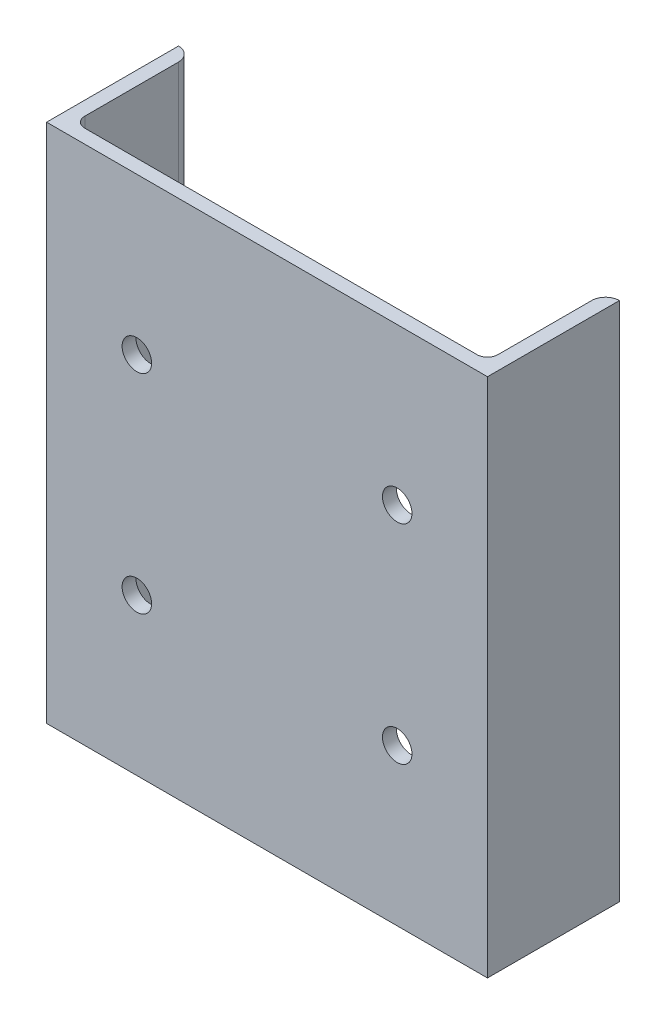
from build123d import *

# Parameters (mm, degrees)
EXTRUDE1_DEPTH     = 150
CUT_EXTRUDE1_REACH = 212.725
SKETCH2_R          = 8.5


with BuildPart() as part:
    # Sketch1 → Extrude1 (new, symmetric)
    with BuildSketch(Plane(origin=(0, 0, 0), x_dir=(1, 0, 0), z_dir=(0, 1, 0))):
        with BuildLine():
            Line((-127, 0), (127, 0))
            Line((127, 0), (127, 76))
            ThreePointArc((127, 76), (121.343145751, 73.656854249), (119, 68))
            Line((119, 68), (119, 14))
            ThreePointArc((119, 14), (117.242640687, 9.757359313), (113, 8))
            Line((113, 8), (-113, 8))
            ThreePointArc((-113, 8), (-117.242640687, 9.757359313), (-119, 14))
            Line((-119, 14), (-119, 68))
            ThreePointArc((-119, 68), (-121.343145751, 73.656854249), (-127, 76))
            Line((-127, 76), (-127, 0))
        make_face()
    extrude(amount=EXTRUDE1_DEPTH, both=True)

    # Sketch2 → Cut-Extrude1 (cut, up to next)
    with BuildSketch(Plane.XY, mode=Mode.PRIVATE) as cut_extrude1_sk1:
        with Locations((75, 60)):
            Circle(SKETCH2_R)
    cut_extrude1_tool1 = extrude(cut_extrude1_sk1.sketch, amount=-CUT_EXTRUDE1_REACH, mode=Mode.PRIVATE) & part.part
    # Sketch2 → Cut-Extrude1 (cut, up to next)
    with BuildSketch(Plane.XY, mode=Mode.PRIVATE) as cut_extrude1_sk2:
        with Locations((-75, 60)):
            Circle(SKETCH2_R)
    cut_extrude1_tool2 = extrude(cut_extrude1_sk2.sketch, amount=-CUT_EXTRUDE1_REACH, mode=Mode.PRIVATE) & part.part
    # Sketch2 → Cut-Extrude1 (cut, up to next)
    with BuildSketch(Plane.XY, mode=Mode.PRIVATE) as cut_extrude1_sk3:
        with Locations((-75, -60)):
            Circle(SKETCH2_R)
    cut_extrude1_tool3 = extrude(cut_extrude1_sk3.sketch, amount=-CUT_EXTRUDE1_REACH, mode=Mode.PRIVATE) & part.part
    # Sketch2 → Cut-Extrude1 (cut, up to next)
    with BuildSketch(Plane.XY, mode=Mode.PRIVATE) as cut_extrude1_sk4:
        with Locations((75, -60)):
            Circle(SKETCH2_R)
    cut_extrude1_tool4 = extrude(cut_extrude1_sk4.sketch, amount=-CUT_EXTRUDE1_REACH, mode=Mode.PRIVATE) & part.part
    add(cut_extrude1_tool1.solids().sort_by_distance((75, 60, 0))[0], mode=Mode.SUBTRACT)
    add(cut_extrude1_tool2.solids().sort_by_distance((-75, 60, 0))[0], mode=Mode.SUBTRACT)
    add(cut_extrude1_tool3.solids().sort_by_distance((-75, -60, 0))[0], mode=Mode.SUBTRACT)
    add(cut_extrude1_tool4.solids().sort_by_distance((75, -60, 0))[0], mode=Mode.SUBTRACT)


solid = part.part
